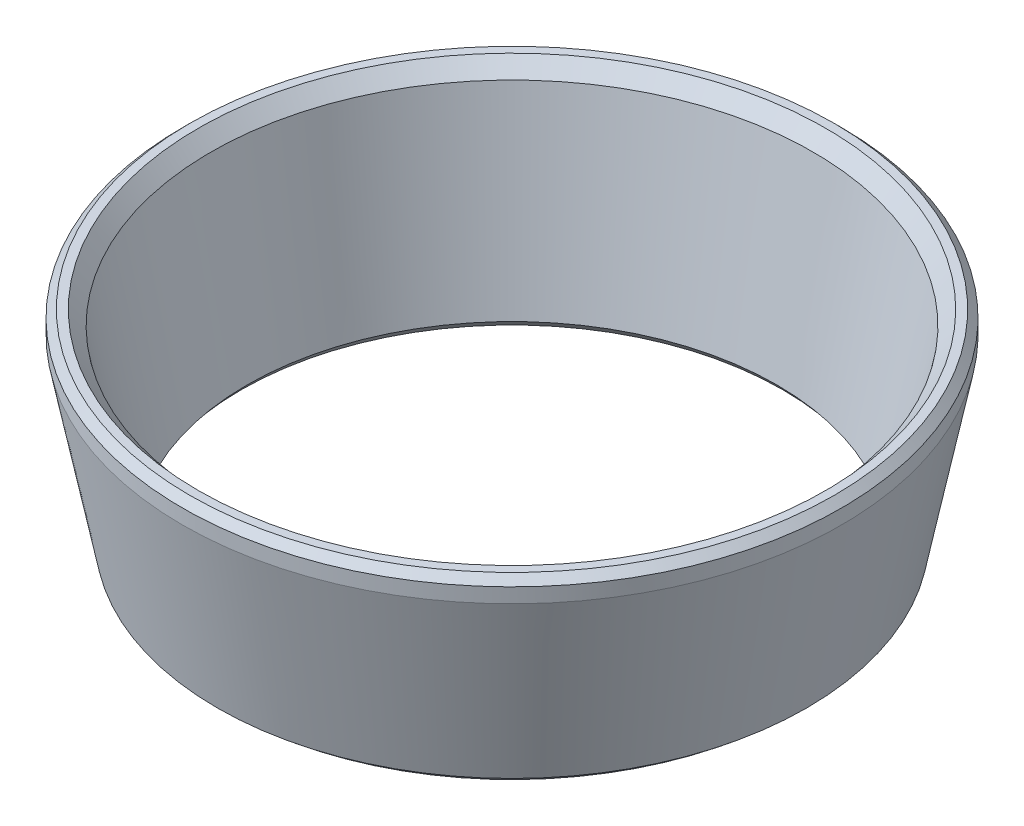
ISO-10303-21;
HEADER;
FILE_DESCRIPTION(('STEP AP214'),'2;1');
FILE_NAME('part.step','',(''),(''),'','','');
FILE_SCHEMA(('AUTOMOTIVE_DESIGN { 1 0 10303 214 1 1 1 1 }'));
ENDSEC;
DATA;
#1=APPLICATION_CONTEXT('core data for automotive mechanical design processes');
#2=APPLICATION_PROTOCOL_DEFINITION('international standard','automotive_design',2000,#1);
#3=PRODUCT_CONTEXT('',#1,'mechanical');
#4=PRODUCT('Part','Part','',(#3));
#5=PRODUCT_RELATED_PRODUCT_CATEGORY('part','',(#4));
#6=PRODUCT_DEFINITION_FORMATION('','',#4);
#7=PRODUCT_DEFINITION_CONTEXT('part definition',#1,'design');
#8=PRODUCT_DEFINITION('design','',#6,#7);
#9=PRODUCT_DEFINITION_SHAPE('','',#8);
#10=(LENGTH_UNIT() NAMED_UNIT(*) SI_UNIT(.MILLI.,.METRE.));
#11=(NAMED_UNIT(*) PLANE_ANGLE_UNIT() SI_UNIT($,.RADIAN.));
#12=(NAMED_UNIT(*) SI_UNIT($,.STERADIAN.) SOLID_ANGLE_UNIT());
#13=UNCERTAINTY_MEASURE_WITH_UNIT(LENGTH_MEASURE(1.E-05),#10,'distance_accuracy_value','');
#14=(GEOMETRIC_REPRESENTATION_CONTEXT(3) GLOBAL_UNCERTAINTY_ASSIGNED_CONTEXT((#13)) GLOBAL_UNIT_ASSIGNED_CONTEXT((#10,
#11,#12)) REPRESENTATION_CONTEXT('',''));
#15=CARTESIAN_POINT('',(0.,0.,0.));
#16=DIRECTION('',(0.,0.,1.));
#17=DIRECTION('',(1.,0.,0.));
#18=AXIS2_PLACEMENT_3D('',#15,#16,#17);
#19=CARTESIAN_POINT('',(0.,14.,0.));
#20=DIRECTION('',(0.,1.,0.));
#21=DIRECTION('',(0.,0.,1.));
#22=AXIS2_PLACEMENT_3D('',#19,#20,#21);
#23=CONICAL_SURFACE('',#22,20.7579771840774,0.195302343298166);
#24=CARTESIAN_POINT('',(0.,0.490494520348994,0.));
#25=DIRECTION('',(0.,-1.,0.));
#26=DIRECTION('',(0.,0.,-1.));
#27=AXIS2_PLACEMENT_3D('',#24,#25,#26);
#28=CIRCLE('',#27,18.0854732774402);
#29=CARTESIAN_POINT('',(0.,0.490494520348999,18.0854732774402));
#30=VERTEX_POINT('',#29);
#31=EDGE_CURVE('E10',#30,#30,#28,.T.);
#32=CARTESIAN_POINT('',(0.,13.0190109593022,0.));
#33=DIRECTION('',(0.,-1.,0.));
#34=DIRECTION('',(0.,0.,-1.));
#35=AXIS2_PLACEMENT_3D('',#32,#33,#34);
#36=CIRCLE('',#35,20.5639140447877);
#37=CARTESIAN_POINT('',(0.,13.0190109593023,20.5639140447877));
#38=VERTEX_POINT('',#37);
#39=EDGE_CURVE('E60',#38,#38,#36,.F.);
#40=CARTESIAN_POINT('',(0.,0.490494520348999,18.0854732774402));
#41=CARTESIAN_POINT('',(0.,0.620999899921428,18.1112903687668));
#42=CARTESIAN_POINT('',(0.,0.751505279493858,18.1371074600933));
#43=CARTESIAN_POINT('',(0.,1.01251603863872,18.1887416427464));
#44=CARTESIAN_POINT('',(0.,1.14302141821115,18.2145587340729));
#45=CARTESIAN_POINT('',(0.,1.40403217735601,18.266192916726));
#46=CARTESIAN_POINT('',(0.,1.53453755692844,18.2920100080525));
#47=CARTESIAN_POINT('',(0.,1.7955483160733,18.3436441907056));
#48=CARTESIAN_POINT('',(0.,1.92605369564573,18.3694612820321));
#49=CARTESIAN_POINT('',(0.,2.18706445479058,18.4210954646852));
#50=CARTESIAN_POINT('',(0.,2.31756983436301,18.4469125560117));
#51=CARTESIAN_POINT('',(0.,2.57858059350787,18.4985467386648));
#52=CARTESIAN_POINT('',(0.,2.7090859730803,18.5243638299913));
#53=CARTESIAN_POINT('',(0.,2.97009673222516,18.5759980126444));
#54=CARTESIAN_POINT('',(0.,3.10060211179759,18.6018151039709));
#55=CARTESIAN_POINT('',(0.,3.36161287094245,18.653449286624));
#56=CARTESIAN_POINT('',(0.,3.49211825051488,18.6792663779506));
#57=CARTESIAN_POINT('',(0.,3.75312900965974,18.7309005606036));
#58=CARTESIAN_POINT('',(0.,3.88363438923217,18.7567176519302));
#59=CARTESIAN_POINT('',(0.,4.14464514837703,18.8083518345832));
#60=CARTESIAN_POINT('',(0.,4.27515052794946,18.8341689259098));
#61=CARTESIAN_POINT('',(0.,4.53616128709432,18.8858031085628));
#62=CARTESIAN_POINT('',(0.,4.66666666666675,18.9116201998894));
#63=CARTESIAN_POINT('',(0.,4.92767742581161,18.9632543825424));
#64=CARTESIAN_POINT('',(0.,5.05818280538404,18.989071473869));
#65=CARTESIAN_POINT('',(0.,5.3191935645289,19.0407056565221));
#66=CARTESIAN_POINT('',(0.,5.44969894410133,19.0665227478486));
#67=CARTESIAN_POINT('',(0.,5.71070970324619,19.1181569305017));
#68=CARTESIAN_POINT('',(0.,5.84121508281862,19.1439740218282));
#69=CARTESIAN_POINT('',(0.,6.10222584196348,19.1956082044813));
#70=CARTESIAN_POINT('',(0.,6.23273122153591,19.2214252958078));
#71=CARTESIAN_POINT('',(0.,6.49374198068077,19.2730594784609));
#72=CARTESIAN_POINT('',(0.,6.6242473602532,19.2988765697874));
#73=CARTESIAN_POINT('',(0.,6.88525811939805,19.3505107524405));
#74=CARTESIAN_POINT('',(0.,7.01576349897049,19.376327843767));
#75=CARTESIAN_POINT('',(0.,7.27677425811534,19.4279620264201));
#76=CARTESIAN_POINT('',(0.,7.40727963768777,19.4537791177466));
#77=CARTESIAN_POINT('',(0.,7.66829039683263,19.5054133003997));
#78=CARTESIAN_POINT('',(0.,7.79879577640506,19.5312303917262));
#79=CARTESIAN_POINT('',(0.,8.05980653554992,19.5828645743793));
#80=CARTESIAN_POINT('',(0.,8.19031191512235,19.6086816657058));
#81=CARTESIAN_POINT('',(0.,8.45132267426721,19.6603158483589));
#82=CARTESIAN_POINT('',(0.,8.58182805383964,19.6861329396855));
#83=CARTESIAN_POINT('',(0.,8.8428388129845,19.7377671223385));
#84=CARTESIAN_POINT('',(0.,8.97334419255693,19.7635842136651));
#85=CARTESIAN_POINT('',(0.,9.23435495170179,19.8152183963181));
#86=CARTESIAN_POINT('',(0.,9.36486033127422,19.8410354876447));
#87=CARTESIAN_POINT('',(0.,9.62587109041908,19.8926696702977));
#88=CARTESIAN_POINT('',(0.,9.75637646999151,19.9184867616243));
#89=CARTESIAN_POINT('',(0.,10.0173872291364,19.9701209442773));
#90=CARTESIAN_POINT('',(0.,10.1478926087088,19.9959380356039));
#91=CARTESIAN_POINT('',(0.,10.4089033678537,20.047572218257));
#92=CARTESIAN_POINT('',(0.,10.5394087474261,20.0733893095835));
#93=CARTESIAN_POINT('',(0.,10.8004195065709,20.1250234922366));
#94=CARTESIAN_POINT('',(0.,10.9309248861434,20.1508405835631));
#95=CARTESIAN_POINT('',(0.,11.1919356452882,20.2024747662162));
#96=CARTESIAN_POINT('',(0.,11.3224410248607,20.2282918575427));
#97=CARTESIAN_POINT('',(0.,11.5834517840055,20.2799260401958));
#98=CARTESIAN_POINT('',(0.,11.713957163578,20.3057431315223));
#99=CARTESIAN_POINT('',(0.,11.9749679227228,20.3573773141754));
#100=CARTESIAN_POINT('',(0.,12.1054733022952,20.3831944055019));
#101=CARTESIAN_POINT('',(0.,12.3664840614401,20.434828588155));
#102=CARTESIAN_POINT('',(0.,12.4969894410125,20.4606456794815));
#103=CARTESIAN_POINT('',(0.,12.7580002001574,20.5122798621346));
#104=CARTESIAN_POINT('',(0.,12.8885055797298,20.5380969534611));
#105=CARTESIAN_POINT('',(0.,13.0190109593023,20.5639140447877));
#106=B_SPLINE_CURVE_WITH_KNOTS('',3,(#40,#41,#42,#43,#44,#45,#46,#47,#48,#49,#50,#51,#52,#53,
#54,#55,#56,#57,#58,#59,#60,#61,#62,#63,#64,#65,#66,#67,#68,#69,#70,#71,#72,#73,#74,#75,#76,#77,
#78,#79,#80,#81,#82,#83,#84,#85,#86,#87,#88,#89,#90,#91,#92,#93,#94,#95,#96,#97,#98,#99,#100,
#101,#102,#103,#104,#105),.UNSPECIFIED.,.F.,.F.,(4,2,2,2,2,2,2,2,2,2,2,2,2,2,2,2,2,2,2,2,2,2,2,
2,2,2,2,2,2,2,2,2,4),(0.,0.399103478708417,0.798206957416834,1.19731043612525,1.59641391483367,
1.99551739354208,2.3946208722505,2.79372435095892,3.19282782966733,3.59193130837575,
3.99103478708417,4.39013826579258,4.789241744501,5.18834522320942,5.58744870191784,
5.98655218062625,6.38565565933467,6.78475913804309,7.1838626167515,7.58296609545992,
7.98206957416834,8.38117305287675,8.78027653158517,9.17938001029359,9.57848348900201,
9.97758696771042,10.3766904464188,10.7757939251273,11.1748974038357,11.5740008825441,
11.9731043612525,12.3722078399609,12.7713113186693),.UNSPECIFIED.);
#107=EDGE_CURVE('BSEAM34',#30,#38,#106,.T.);
#108=ORIENTED_EDGE('',*,*,#31,.T.);
#109=ORIENTED_EDGE('',*,*,#39,.T.);
#110=ORIENTED_EDGE('',*,*,#107,.T.);
#111=ORIENTED_EDGE('',*,*,#107,.F.);
#112=EDGE_LOOP('',(#108,#110,#109,#111));
#113=FACE_BOUND('',#112,.T.);
#114=ADVANCED_FACE('F34',(#113),#23,.F.);
#115=CARTESIAN_POINT('',(20.7579771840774,14.,0.));
#116=DIRECTION('',(0.,1.,0.));
#117=DIRECTION('',(0.,0.,1.));
#118=AXIS2_PLACEMENT_3D('',#115,#116,#117);
#119=PLANE('',#118);
#120=CARTESIAN_POINT('',(0.,14.,0.));
#121=DIRECTION('',(0.,1.,0.));
#122=DIRECTION('',(0.,0.,1.));
#123=AXIS2_PLACEMENT_3D('',#120,#121,#122);
#124=CIRCLE('',#123,22.);
#125=CARTESIAN_POINT('',(0.,14.,-21.9999999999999));
#126=VERTEX_POINT('',#125);
#127=EDGE_CURVE('E54',#126,#126,#124,.T.);
#128=ORIENTED_EDGE('',*,*,#127,.T.);
#129=EDGE_LOOP('',(#128));
#130=FACE_BOUND('',#129,.T.);
#131=CARTESIAN_POINT('',(0.,14.,0.));
#132=DIRECTION('',(0.,1.,0.));
#133=DIRECTION('',(0.,0.,1.));
#134=AXIS2_PLACEMENT_3D('',#131,#132,#133);
#135=CIRCLE('',#134,21.4224026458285);
#136=CARTESIAN_POINT('',(0.,14.,21.4224026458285));
#137=VERTEX_POINT('',#136);
#138=EDGE_CURVE('E63',#137,#137,#135,.F.);
#139=ORIENTED_EDGE('',*,*,#138,.T.);
#140=EDGE_LOOP('',(#139));
#141=FACE_BOUND('',#140,.T.);
#142=ADVANCED_FACE('F74',(#130,#141),#119,.T.);
#143=CARTESIAN_POINT('',(0.,1.11022302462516E-13,0.));
#144=DIRECTION('',(0.,-1.,0.));
#145=DIRECTION('',(0.,0.,-1.));
#146=AXIS2_PLACEMENT_3D('',#143,#144,#145);
#147=CYLINDRICAL_SURFACE('',#146,22.5);
#148=CARTESIAN_POINT('',(0.,13.5,0.));
#149=DIRECTION('',(0.,1.,0.));
#150=DIRECTION('',(0.,0.,1.));
#151=AXIS2_PLACEMENT_3D('',#148,#149,#150);
#152=CIRCLE('',#151,22.5);
#153=CARTESIAN_POINT('',(0.,13.5,-22.5));
#154=VERTEX_POINT('',#153);
#155=EDGE_CURVE('E57',#154,#154,#152,.F.);
#156=CARTESIAN_POINT('',(0.,12.5,0.));
#157=DIRECTION('',(0.,-1.,0.));
#158=DIRECTION('',(0.,0.,-1.));
#159=AXIS2_PLACEMENT_3D('',#156,#157,#158);
#160=CIRCLE('',#159,22.5);
#161=CARTESIAN_POINT('',(0.,12.5,-22.5));
#162=VERTEX_POINT('',#161);
#163=EDGE_CURVE('E66',#162,#162,#160,.T.);
#164=CARTESIAN_POINT('',(0.,13.5,-22.5));
#165=CARTESIAN_POINT('',(0.,13.4895833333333,-22.5));
#166=CARTESIAN_POINT('',(0.,13.4791666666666,-22.5));
#167=CARTESIAN_POINT('',(0.,13.4583333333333,-22.5));
#168=CARTESIAN_POINT('',(0.,13.4479166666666,-22.5));
#169=CARTESIAN_POINT('',(0.,13.4270833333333,-22.5));
#170=CARTESIAN_POINT('',(0.,13.4166666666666,-22.5));
#171=CARTESIAN_POINT('',(0.,13.3958333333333,-22.5));
#172=CARTESIAN_POINT('',(0.,13.3854166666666,-22.5));
#173=CARTESIAN_POINT('',(0.,13.3645833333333,-22.5));
#174=CARTESIAN_POINT('',(0.,13.3541666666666,-22.5));
#175=CARTESIAN_POINT('',(0.,13.3333333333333,-22.5));
#176=CARTESIAN_POINT('',(0.,13.3229166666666,-22.5));
#177=CARTESIAN_POINT('',(0.,13.3020833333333,-22.5));
#178=CARTESIAN_POINT('',(0.,13.2916666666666,-22.5));
#179=CARTESIAN_POINT('',(0.,13.2708333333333,-22.5));
#180=CARTESIAN_POINT('',(0.,13.2604166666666,-22.5));
#181=CARTESIAN_POINT('',(0.,13.2395833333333,-22.5));
#182=CARTESIAN_POINT('',(0.,13.2291666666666,-22.5));
#183=CARTESIAN_POINT('',(0.,13.2083333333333,-22.5));
#184=CARTESIAN_POINT('',(0.,13.1979166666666,-22.5));
#185=CARTESIAN_POINT('',(0.,13.1770833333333,-22.5));
#186=CARTESIAN_POINT('',(0.,13.1666666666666,-22.5));
#187=CARTESIAN_POINT('',(0.,13.1458333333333,-22.5));
#188=CARTESIAN_POINT('',(0.,13.1354166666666,-22.5));
#189=CARTESIAN_POINT('',(0.,13.1145833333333,-22.5));
#190=CARTESIAN_POINT('',(0.,13.1041666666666,-22.5));
#191=CARTESIAN_POINT('',(0.,13.0833333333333,-22.5));
#192=CARTESIAN_POINT('',(0.,13.0729166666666,-22.5));
#193=CARTESIAN_POINT('',(0.,13.0520833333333,-22.5));
#194=CARTESIAN_POINT('',(0.,13.0416666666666,-22.5));
#195=CARTESIAN_POINT('',(0.,13.0208333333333,-22.5));
#196=CARTESIAN_POINT('',(0.,13.0104166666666,-22.5));
#197=CARTESIAN_POINT('',(0.,12.9895833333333,-22.5));
#198=CARTESIAN_POINT('',(0.,12.9791666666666,-22.5));
#199=CARTESIAN_POINT('',(0.,12.9583333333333,-22.5));
#200=CARTESIAN_POINT('',(0.,12.9479166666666,-22.5));
#201=CARTESIAN_POINT('',(0.,12.9270833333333,-22.5));
#202=CARTESIAN_POINT('',(0.,12.9166666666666,-22.5));
#203=CARTESIAN_POINT('',(0.,12.8958333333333,-22.5));
#204=CARTESIAN_POINT('',(0.,12.8854166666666,-22.5));
#205=CARTESIAN_POINT('',(0.,12.8645833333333,-22.5));
#206=CARTESIAN_POINT('',(0.,12.8541666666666,-22.5));
#207=CARTESIAN_POINT('',(0.,12.8333333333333,-22.5));
#208=CARTESIAN_POINT('',(0.,12.8229166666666,-22.5));
#209=CARTESIAN_POINT('',(0.,12.8020833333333,-22.5));
#210=CARTESIAN_POINT('',(0.,12.7916666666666,-22.5));
#211=CARTESIAN_POINT('',(0.,12.7708333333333,-22.5));
#212=CARTESIAN_POINT('',(0.,12.7604166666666,-22.5));
#213=CARTESIAN_POINT('',(0.,12.7395833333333,-22.5));
#214=CARTESIAN_POINT('',(0.,12.7291666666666,-22.5));
#215=CARTESIAN_POINT('',(0.,12.7083333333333,-22.5));
#216=CARTESIAN_POINT('',(0.,12.6979166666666,-22.5));
#217=CARTESIAN_POINT('',(0.,12.6770833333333,-22.5));
#218=CARTESIAN_POINT('',(0.,12.6666666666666,-22.5));
#219=CARTESIAN_POINT('',(0.,12.6458333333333,-22.5));
#220=CARTESIAN_POINT('',(0.,12.6354166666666,-22.5));
#221=CARTESIAN_POINT('',(0.,12.6145833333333,-22.5));
#222=CARTESIAN_POINT('',(0.,12.6041666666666,-22.5));
#223=CARTESIAN_POINT('',(0.,12.5833333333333,-22.5));
#224=CARTESIAN_POINT('',(0.,12.5729166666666,-22.5));
#225=CARTESIAN_POINT('',(0.,12.5520833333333,-22.5));
#226=CARTESIAN_POINT('',(0.,12.5416666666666,-22.5));
#227=CARTESIAN_POINT('',(0.,12.5208333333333,-22.5));
#228=CARTESIAN_POINT('',(0.,12.5104166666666,-22.5));
#229=CARTESIAN_POINT('',(0.,12.5,-22.5));
#230=B_SPLINE_CURVE_WITH_KNOTS('',3,(#164,#165,#166,#167,#168,#169,#170,#171,#172,#173,#174,
#175,#176,#177,#178,#179,#180,#181,#182,#183,#184,#185,#186,#187,#188,#189,#190,#191,#192,#193,
#194,#195,#196,#197,#198,#199,#200,#201,#202,#203,#204,#205,#206,#207,#208,#209,#210,#211,#212,
#213,#214,#215,#216,#217,#218,#219,#220,#221,#222,#223,#224,#225,#226,#227,#228,#229),
.UNSPECIFIED.,.F.,.F.,(4,2,2,2,2,2,2,2,2,2,2,2,2,2,2,2,2,2,2,2,2,2,2,2,2,2,2,2,2,2,2,2,4),(0.,
0.03125,0.0625000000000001,0.0937500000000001,0.125,0.15625,0.1875,0.21875,0.25,0.28125,0.3125,
0.34375,0.375,0.40625,0.4375,0.46875,0.5,0.53125,0.5625,0.593750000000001,0.625000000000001,
0.656250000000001,0.687500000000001,0.718750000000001,0.750000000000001,0.781250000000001,
0.812500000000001,0.843750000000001,0.875000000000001,0.906250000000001,0.937500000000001,
0.968750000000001,1.),.UNSPECIFIED.);
#231=EDGE_CURVE('BSEAM72',#154,#162,#230,.T.);
#232=ORIENTED_EDGE('',*,*,#155,.T.);
#233=ORIENTED_EDGE('',*,*,#163,.F.);
#234=ORIENTED_EDGE('',*,*,#231,.T.);
#235=ORIENTED_EDGE('',*,*,#231,.F.);
#236=EDGE_LOOP('',(#232,#234,#233,#235));
#237=FACE_BOUND('',#236,.T.);
#238=ADVANCED_FACE('F72',(#237),#147,.T.);
#239=CARTESIAN_POINT('',(0.,1.11022302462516E-13,0.));
#240=DIRECTION('',(0.,1.,0.));
#241=DIRECTION('',(0.,0.,1.));
#242=AXIS2_PLACEMENT_3D('',#239,#240,#241);
#243=CONICAL_SURFACE('',#242,20.0272004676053,0.195302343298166);
#244=CARTESIAN_POINT('',(0.,0.490494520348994,0.));
#245=DIRECTION('',(0.,-1.,0.));
#246=DIRECTION('',(0.,0.,-1.));
#247=AXIS2_PLACEMENT_3D('',#244,#245,#246);
#248=CIRCLE('',#247,20.1242320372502);
#249=CARTESIAN_POINT('',(0.,0.490494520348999,20.1242320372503));
#250=VERTEX_POINT('',#249);
#251=EDGE_CURVE('E41',#250,#250,#248,.F.);
#252=ORIENTED_EDGE('',*,*,#251,.T.);
#253=EDGE_LOOP('',(#252));
#254=FACE_BOUND('',#253,.T.);
#255=ORIENTED_EDGE('',*,*,#163,.T.);
#256=EDGE_LOOP('',(#255));
#257=FACE_BOUND('',#256,.T.);
#258=ADVANCED_FACE('F70',(#254,#257),#243,.T.);
#259=CARTESIAN_POINT('',(20.0272004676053,0.,0.));
#260=DIRECTION('',(0.,-1.,0.));
#261=DIRECTION('',(0.,0.,-1.));
#262=AXIS2_PLACEMENT_3D('',#259,#260,#261);
#263=PLANE('',#262);
#264=CARTESIAN_POINT('',(0.,1.11022302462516E-13,0.));
#265=DIRECTION('',(0.,-1.,0.));
#266=DIRECTION('',(0.,0.,-1.));
#267=AXIS2_PLACEMENT_3D('',#264,#265,#266);
#268=CIRCLE('',#267,19.5272004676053);
#269=CARTESIAN_POINT('',(0.,1.16171195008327E-13,19.5272004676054));
#270=VERTEX_POINT('',#269);
#271=EDGE_CURVE('E45',#270,#270,#268,.T.);
#272=ORIENTED_EDGE('',*,*,#271,.T.);
#273=EDGE_LOOP('',(#272));
#274=FACE_BOUND('',#273,.T.);
#275=CARTESIAN_POINT('',(0.,1.11022302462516E-13,0.));
#276=DIRECTION('',(0.,-1.,0.));
#277=DIRECTION('',(0.,0.,-1.));
#278=AXIS2_PLACEMENT_3D('',#275,#276,#277);
#279=CIRCLE('',#278,18.4884417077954);
#280=CARTESIAN_POINT('',(0.,1.15897297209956E-13,-18.4884417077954));
#281=VERTEX_POINT('',#280);
#282=EDGE_CURVE('E49',#281,#281,#279,.F.);
#283=ORIENTED_EDGE('',*,*,#282,.T.);
#284=EDGE_LOOP('',(#283));
#285=FACE_BOUND('',#284,.T.);
#286=ADVANCED_FACE('F81',(#274,#285),#263,.T.);
#287=CARTESIAN_POINT('',(0.,14.,0.));
#288=DIRECTION('',(0.,1.,0.));
#289=DIRECTION('',(0.,0.,1.));
#290=AXIS2_PLACEMENT_3D('',#287,#288,#289);
#291=CONICAL_SURFACE('',#290,21.4224026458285,0.718901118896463);
#292=CARTESIAN_POINT('',(0.,13.0190109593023,20.5639140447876));
#293=CARTESIAN_POINT('',(0.,13.0292295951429,20.5728566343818));
#294=CARTESIAN_POINT('',(0.,13.0394482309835,20.581799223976));
#295=CARTESIAN_POINT('',(0.,13.0598855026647,20.5996844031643));
#296=CARTESIAN_POINT('',(0.,13.0701041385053,20.6086269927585));
#297=CARTESIAN_POINT('',(0.,13.0905414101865,20.6265121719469));
#298=CARTESIAN_POINT('',(0.,13.1007600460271,20.635454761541));
#299=CARTESIAN_POINT('',(0.,13.1211973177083,20.6533399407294));
#300=CARTESIAN_POINT('',(0.,13.1314159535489,20.6622825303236));
#301=CARTESIAN_POINT('',(0.,13.1518532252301,20.6801677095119));
#302=CARTESIAN_POINT('',(0.,13.1620718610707,20.6891102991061));
#303=CARTESIAN_POINT('',(0.,13.1825091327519,20.7069954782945));
#304=CARTESIAN_POINT('',(0.,13.1927277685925,20.7159380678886));
#305=CARTESIAN_POINT('',(0.,13.2131650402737,20.733823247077));
#306=CARTESIAN_POINT('',(0.,13.2233836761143,20.7427658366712));
#307=CARTESIAN_POINT('',(0.,13.2438209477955,20.7606510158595));
#308=CARTESIAN_POINT('',(0.,13.2540395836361,20.7695936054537));
#309=CARTESIAN_POINT('',(0.,13.2744768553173,20.787478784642));
#310=CARTESIAN_POINT('',(0.,13.2846954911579,20.7964213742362));
#311=CARTESIAN_POINT('',(0.,13.3051327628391,20.8143065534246));
#312=CARTESIAN_POINT('',(0.,13.3153513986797,20.8232491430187));
#313=CARTESIAN_POINT('',(0.,13.3357886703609,20.8411343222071));
#314=CARTESIAN_POINT('',(0.,13.3460073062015,20.8500769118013));
#315=CARTESIAN_POINT('',(0.,13.3664445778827,20.8679620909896));
#316=CARTESIAN_POINT('',(0.,13.3766632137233,20.8769046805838));
#317=CARTESIAN_POINT('',(0.,13.3971004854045,20.8947898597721));
#318=CARTESIAN_POINT('',(0.,13.4073191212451,20.9037324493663));
#319=CARTESIAN_POINT('',(0.,13.4277563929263,20.9216176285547));
#320=CARTESIAN_POINT('',(0.,13.4379750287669,20.9305602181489));
#321=CARTESIAN_POINT('',(0.,13.4584123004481,20.9484453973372));
#322=CARTESIAN_POINT('',(0.,13.4686309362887,20.9573879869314));
#323=CARTESIAN_POINT('',(0.,13.4890682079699,20.9752731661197));
#324=CARTESIAN_POINT('',(0.,13.4992868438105,20.9842157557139));
#325=CARTESIAN_POINT('',(0.,13.5197241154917,21.0021009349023));
#326=CARTESIAN_POINT('',(0.,13.5299427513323,21.0110435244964));
#327=CARTESIAN_POINT('',(0.,13.5503800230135,21.0289287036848));
#328=CARTESIAN_POINT('',(0.,13.5605986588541,21.037871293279));
#329=CARTESIAN_POINT('',(0.,13.5810359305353,21.0557564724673));
#330=CARTESIAN_POINT('',(0.,13.5912545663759,21.0646990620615));
#331=CARTESIAN_POINT('',(0.,13.6116918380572,21.0825842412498));
#332=CARTESIAN_POINT('',(0.,13.6219104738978,21.091526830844));
#333=CARTESIAN_POINT('',(0.,13.642347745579,21.1094120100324));
#334=CARTESIAN_POINT('',(0.,13.6525663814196,21.1183545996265));
#335=CARTESIAN_POINT('',(0.,13.6730036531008,21.1362397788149));
#336=CARTESIAN_POINT('',(0.,13.6832222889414,21.1451823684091));
#337=CARTESIAN_POINT('',(0.,13.7036595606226,21.1630675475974));
#338=CARTESIAN_POINT('',(0.,13.7138781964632,21.1720101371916));
#339=CARTESIAN_POINT('',(0.,13.7343154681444,21.1898953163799));
#340=CARTESIAN_POINT('',(0.,13.744534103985,21.1988379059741));
#341=CARTESIAN_POINT('',(0.,13.7649713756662,21.2167230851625));
#342=CARTESIAN_POINT('',(0.,13.7751900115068,21.2256656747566));
#343=CARTESIAN_POINT('',(0.,13.795627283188,21.243550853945));
#344=CARTESIAN_POINT('',(0.,13.8058459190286,21.2524934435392));
#345=CARTESIAN_POINT('',(0.,13.8262831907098,21.2703786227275));
#346=CARTESIAN_POINT('',(0.,13.8365018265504,21.2793212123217));
#347=CARTESIAN_POINT('',(0.,13.8569390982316,21.2972063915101));
#348=CARTESIAN_POINT('',(0.,13.8671577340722,21.3061489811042));
#349=CARTESIAN_POINT('',(0.,13.8875950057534,21.3240341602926));
#350=CARTESIAN_POINT('',(0.,13.897813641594,21.3329767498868));
#351=CARTESIAN_POINT('',(0.,13.9182509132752,21.3508619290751));
#352=CARTESIAN_POINT('',(0.,13.9284695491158,21.3598045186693));
#353=CARTESIAN_POINT('',(0.,13.948906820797,21.3776896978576));
#354=CARTESIAN_POINT('',(0.,13.9591254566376,21.3866322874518));
#355=CARTESIAN_POINT('',(0.,13.9795627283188,21.4045174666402));
#356=CARTESIAN_POINT('',(0.,13.9897813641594,21.4134600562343));
#357=CARTESIAN_POINT('',(0.,14.,21.4224026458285));
#358=B_SPLINE_CURVE_WITH_KNOTS('',3,(#292,#293,#294,#295,#296,#297,#298,#299,#300,#301,#302,
#303,#304,#305,#306,#307,#308,#309,#310,#311,#312,#313,#314,#315,#316,#317,#318,#319,#320,#321,
#322,#323,#324,#325,#326,#327,#328,#329,#330,#331,#332,#333,#334,#335,#336,#337,#338,#339,#340,
#341,#342,#343,#344,#345,#346,#347,#348,#349,#350,#351,#352,#353,#354,#355,#356,#357),
.UNSPECIFIED.,.F.,.F.,(4,2,2,2,2,2,2,2,2,2,2,2,2,2,2,2,2,2,2,2,2,2,2,2,2,2,2,2,2,2,2,2,4),(0.,
0.0407371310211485,0.081474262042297,0.122211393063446,0.162948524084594,0.203685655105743,
0.244422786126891,0.28515991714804,0.325897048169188,0.366634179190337,0.407371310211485,
0.448108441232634,0.488845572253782,0.529582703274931,0.570319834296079,0.611056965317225,
0.651794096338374,0.692531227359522,0.733268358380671,0.774005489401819,0.814742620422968,
0.855479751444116,0.896216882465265,0.936954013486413,0.977691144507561,1.01842827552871,
1.05916540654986,1.09990253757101,1.14063966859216,1.18137679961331,1.22211393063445,
1.2628510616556,1.30358819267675),.UNSPECIFIED.);
#359=EDGE_CURVE('BSEAM91',#38,#137,#358,.T.);
#360=ORIENTED_EDGE('',*,*,#39,.F.);
#361=ORIENTED_EDGE('',*,*,#138,.F.);
#362=ORIENTED_EDGE('',*,*,#359,.T.);
#363=ORIENTED_EDGE('',*,*,#359,.F.);
#364=EDGE_LOOP('',(#360,#362,#361,#363));
#365=FACE_BOUND('',#364,.T.);
#366=ADVANCED_FACE('F91',(#365),#291,.F.);
#367=CARTESIAN_POINT('',(0.,13.5,0.));
#368=DIRECTION('',(0.,-1.,0.));
#369=DIRECTION('',(0.,0.,-1.));
#370=AXIS2_PLACEMENT_3D('',#367,#368,#369);
#371=CONICAL_SURFACE('',#370,22.5,0.785398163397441);
#372=CARTESIAN_POINT('',(0.,14.,-21.9999999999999));
#373=CARTESIAN_POINT('',(0.,13.9947916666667,-22.0052083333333));
#374=CARTESIAN_POINT('',(0.,13.9895833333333,-22.0104166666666));
#375=CARTESIAN_POINT('',(0.,13.9791666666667,-22.0208333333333));
#376=CARTESIAN_POINT('',(0.,13.9739583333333,-22.0260416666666));
#377=CARTESIAN_POINT('',(0.,13.9635416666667,-22.0364583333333));
#378=CARTESIAN_POINT('',(0.,13.9583333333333,-22.0416666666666));
#379=CARTESIAN_POINT('',(0.,13.9479166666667,-22.0520833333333));
#380=CARTESIAN_POINT('',(0.,13.9427083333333,-22.0572916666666));
#381=CARTESIAN_POINT('',(0.,13.9322916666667,-22.0677083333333));
#382=CARTESIAN_POINT('',(0.,13.9270833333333,-22.0729166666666));
#383=CARTESIAN_POINT('',(0.,13.9166666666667,-22.0833333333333));
#384=CARTESIAN_POINT('',(0.,13.9114583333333,-22.0885416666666));
#385=CARTESIAN_POINT('',(0.,13.9010416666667,-22.0989583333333));
#386=CARTESIAN_POINT('',(0.,13.8958333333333,-22.1041666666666));
#387=CARTESIAN_POINT('',(0.,13.8854166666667,-22.1145833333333));
#388=CARTESIAN_POINT('',(0.,13.8802083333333,-22.1197916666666));
#389=CARTESIAN_POINT('',(0.,13.8697916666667,-22.1302083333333));
#390=CARTESIAN_POINT('',(0.,13.8645833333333,-22.1354166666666));
#391=CARTESIAN_POINT('',(0.,13.8541666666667,-22.1458333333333));
#392=CARTESIAN_POINT('',(0.,13.8489583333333,-22.1510416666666));
#393=CARTESIAN_POINT('',(0.,13.8385416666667,-22.1614583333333));
#394=CARTESIAN_POINT('',(0.,13.8333333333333,-22.1666666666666));
#395=CARTESIAN_POINT('',(0.,13.8229166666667,-22.1770833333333));
#396=CARTESIAN_POINT('',(0.,13.8177083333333,-22.1822916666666));
#397=CARTESIAN_POINT('',(0.,13.8072916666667,-22.1927083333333));
#398=CARTESIAN_POINT('',(0.,13.8020833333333,-22.1979166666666));
#399=CARTESIAN_POINT('',(0.,13.7916666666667,-22.2083333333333));
#400=CARTESIAN_POINT('',(0.,13.7864583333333,-22.2135416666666));
#401=CARTESIAN_POINT('',(0.,13.7760416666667,-22.2239583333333));
#402=CARTESIAN_POINT('',(0.,13.7708333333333,-22.2291666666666));
#403=CARTESIAN_POINT('',(0.,13.7604166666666,-22.2395833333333));
#404=CARTESIAN_POINT('',(0.,13.7552083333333,-22.2447916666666));
#405=CARTESIAN_POINT('',(0.,13.7447916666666,-22.2552083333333));
#406=CARTESIAN_POINT('',(0.,13.7395833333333,-22.2604166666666));
#407=CARTESIAN_POINT('',(0.,13.7291666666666,-22.2708333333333));
#408=CARTESIAN_POINT('',(0.,13.7239583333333,-22.2760416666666));
#409=CARTESIAN_POINT('',(0.,13.7135416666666,-22.2864583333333));
#410=CARTESIAN_POINT('',(0.,13.7083333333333,-22.2916666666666));
#411=CARTESIAN_POINT('',(0.,13.6979166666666,-22.3020833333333));
#412=CARTESIAN_POINT('',(0.,13.6927083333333,-22.3072916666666));
#413=CARTESIAN_POINT('',(0.,13.6822916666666,-22.3177083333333));
#414=CARTESIAN_POINT('',(0.,13.6770833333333,-22.3229166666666));
#415=CARTESIAN_POINT('',(0.,13.6666666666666,-22.3333333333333));
#416=CARTESIAN_POINT('',(0.,13.6614583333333,-22.3385416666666));
#417=CARTESIAN_POINT('',(0.,13.6510416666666,-22.3489583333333));
#418=CARTESIAN_POINT('',(0.,13.6458333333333,-22.3541666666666));
#419=CARTESIAN_POINT('',(0.,13.6354166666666,-22.3645833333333));
#420=CARTESIAN_POINT('',(0.,13.6302083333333,-22.3697916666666));
#421=CARTESIAN_POINT('',(0.,13.6197916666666,-22.3802083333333));
#422=CARTESIAN_POINT('',(0.,13.6145833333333,-22.3854166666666));
#423=CARTESIAN_POINT('',(0.,13.6041666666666,-22.3958333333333));
#424=CARTESIAN_POINT('',(0.,13.5989583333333,-22.4010416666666));
#425=CARTESIAN_POINT('',(0.,13.5885416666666,-22.4114583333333));
#426=CARTESIAN_POINT('',(0.,13.5833333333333,-22.4166666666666));
#427=CARTESIAN_POINT('',(0.,13.5729166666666,-22.4270833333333));
#428=CARTESIAN_POINT('',(0.,13.5677083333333,-22.4322916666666));
#429=CARTESIAN_POINT('',(0.,13.5572916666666,-22.4427083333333));
#430=CARTESIAN_POINT('',(0.,13.5520833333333,-22.4479166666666));
#431=CARTESIAN_POINT('',(0.,13.5416666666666,-22.4583333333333));
#432=CARTESIAN_POINT('',(0.,13.5364583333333,-22.4635416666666));
#433=CARTESIAN_POINT('',(0.,13.5260416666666,-22.4739583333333));
#434=CARTESIAN_POINT('',(0.,13.5208333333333,-22.4791666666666));
#435=CARTESIAN_POINT('',(0.,13.5104166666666,-22.4895833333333));
#436=CARTESIAN_POINT('',(0.,13.5052083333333,-22.4947916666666));
#437=CARTESIAN_POINT('',(0.,13.5,-22.5));
#438=B_SPLINE_CURVE_WITH_KNOTS('',3,(#372,#373,#374,#375,#376,#377,#378,#379,#380,#381,#382,
#383,#384,#385,#386,#387,#388,#389,#390,#391,#392,#393,#394,#395,#396,#397,#398,#399,#400,#401,
#402,#403,#404,#405,#406,#407,#408,#409,#410,#411,#412,#413,#414,#415,#416,#417,#418,#419,#420,
#421,#422,#423,#424,#425,#426,#427,#428,#429,#430,#431,#432,#433,#434,#435,#436,#437),
.UNSPECIFIED.,.F.,.F.,(4,2,2,2,2,2,2,2,2,2,2,2,2,2,2,2,2,2,2,2,2,2,2,2,2,2,2,2,2,2,2,2,4),(0.,
0.0220970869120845,0.0441941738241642,0.0662912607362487,0.0883883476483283,0.110485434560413,
0.132582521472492,0.154679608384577,0.176776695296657,0.198873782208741,0.220970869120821,
0.243067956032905,0.265165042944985,0.287262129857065,0.309359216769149,0.331456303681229,
0.353553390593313,0.375650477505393,0.397747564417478,0.419844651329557,0.441941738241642,
0.464038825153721,0.486135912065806,0.508232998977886,0.53033008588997,0.55242717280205,
0.574524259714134,0.596621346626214,0.6187184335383,0.640815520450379,0.662912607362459,
0.685009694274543,0.707106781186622),.UNSPECIFIED.);
#439=EDGE_CURVE('BSEAM94',#126,#154,#438,.T.);
#440=ORIENTED_EDGE('',*,*,#127,.F.);
#441=ORIENTED_EDGE('',*,*,#155,.F.);
#442=ORIENTED_EDGE('',*,*,#439,.T.);
#443=ORIENTED_EDGE('',*,*,#439,.F.);
#444=EDGE_LOOP('',(#440,#442,#441,#443));
#445=FACE_BOUND('',#444,.T.);
#446=ADVANCED_FACE('F94',(#445),#371,.T.);
#447=CARTESIAN_POINT('',(0.,1.11022302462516E-13,0.));
#448=DIRECTION('',(0.,1.,0.));
#449=DIRECTION('',(0.,0.,1.));
#450=AXIS2_PLACEMENT_3D('',#447,#448,#449);
#451=CONICAL_SURFACE('',#450,19.5272004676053,0.883049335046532);
#452=CARTESIAN_POINT('',(0.,0.490494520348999,20.1242320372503));
#453=CARTESIAN_POINT('',(0.,0.485385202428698,20.1180129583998));
#454=CARTESIAN_POINT('',(0.,0.480275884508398,20.1117938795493));
#455=CARTESIAN_POINT('',(0.,0.470057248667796,20.0993557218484));
#456=CARTESIAN_POINT('',(0.,0.464947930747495,20.0931366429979));
#457=CARTESIAN_POINT('',(0.,0.454729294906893,20.080698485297));
#458=CARTESIAN_POINT('',(0.,0.449619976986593,20.0744794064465));
#459=CARTESIAN_POINT('',(0.,0.43940134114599,20.0620412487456));
#460=CARTESIAN_POINT('',(0.,0.434292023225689,20.0558221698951));
#461=CARTESIAN_POINT('',(0.,0.424073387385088,20.0433840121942));
#462=CARTESIAN_POINT('',(0.,0.418964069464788,20.0371649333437));
#463=CARTESIAN_POINT('',(0.,0.408745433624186,20.0247267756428));
#464=CARTESIAN_POINT('',(0.,0.403636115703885,20.0185076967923));
#465=CARTESIAN_POINT('',(0.,0.393417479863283,20.0060695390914));
#466=CARTESIAN_POINT('',(0.,0.388308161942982,19.9998504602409));
#467=CARTESIAN_POINT('',(0.,0.37808952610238,19.98741230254));
#468=CARTESIAN_POINT('',(0.,0.37298020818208,19.9811932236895));
#469=CARTESIAN_POINT('',(0.,0.362761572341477,19.9687550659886));
#470=CARTESIAN_POINT('',(0.,0.357652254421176,19.9625359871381));
#471=CARTESIAN_POINT('',(0.,0.347433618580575,19.9500978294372));
#472=CARTESIAN_POINT('',(0.,0.342324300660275,19.9438787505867));
#473=CARTESIAN_POINT('',(0.,0.332105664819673,19.9314405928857));
#474=CARTESIAN_POINT('',(0.,0.326996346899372,19.9252215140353));
#475=CARTESIAN_POINT('',(0.,0.31677771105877,19.9127833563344));
#476=CARTESIAN_POINT('',(0.,0.311668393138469,19.9065642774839));
#477=CARTESIAN_POINT('',(0.,0.301449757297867,19.8941261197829));
#478=CARTESIAN_POINT('',(0.,0.296340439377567,19.8879070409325));
#479=CARTESIAN_POINT('',(0.,0.286121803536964,19.8754688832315));
#480=CARTESIAN_POINT('',(0.,0.281012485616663,19.8692498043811));
#481=CARTESIAN_POINT('',(0.,0.270793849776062,19.8568116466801));
#482=CARTESIAN_POINT('',(0.,0.265684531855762,19.8505925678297));
#483=CARTESIAN_POINT('',(0.,0.25546589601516,19.8381544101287));
#484=CARTESIAN_POINT('',(0.,0.250356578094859,19.8319353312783));
#485=CARTESIAN_POINT('',(0.,0.240137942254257,19.8194971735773));
#486=CARTESIAN_POINT('',(0.,0.235028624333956,19.8132780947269));
#487=CARTESIAN_POINT('',(0.,0.224809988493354,19.8008399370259));
#488=CARTESIAN_POINT('',(0.,0.219700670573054,19.7946208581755));
#489=CARTESIAN_POINT('',(0.,0.209482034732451,19.7821827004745));
#490=CARTESIAN_POINT('',(0.,0.20437271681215,19.7759636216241));
#491=CARTESIAN_POINT('',(0.,0.194154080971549,19.7635254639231));
#492=CARTESIAN_POINT('',(0.,0.189044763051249,19.7573063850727));
#493=CARTESIAN_POINT('',(0.,0.178826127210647,19.7448682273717));
#494=CARTESIAN_POINT('',(0.,0.173716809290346,19.7386491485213));
#495=CARTESIAN_POINT('',(0.,0.163498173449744,19.7262109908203));
#496=CARTESIAN_POINT('',(0.,0.158388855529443,19.7199919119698));
#497=CARTESIAN_POINT('',(0.,0.148170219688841,19.7075537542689));
#498=CARTESIAN_POINT('',(0.,0.143060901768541,19.7013346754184));
#499=CARTESIAN_POINT('',(0.,0.132842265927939,19.6888965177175));
#500=CARTESIAN_POINT('',(0.,0.127732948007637,19.682677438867));
#501=CARTESIAN_POINT('',(0.,0.117514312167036,19.6702392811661));
#502=CARTESIAN_POINT('',(0.,0.112404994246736,19.6640202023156));
#503=CARTESIAN_POINT('',(0.,0.102186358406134,19.6515820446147));
#504=CARTESIAN_POINT('',(0.,0.0970770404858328,19.6453629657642));
#505=CARTESIAN_POINT('',(0.,0.0868584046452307,19.6329248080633));
#506=CARTESIAN_POINT('',(0.,0.0817490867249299,19.6267057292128));
#507=CARTESIAN_POINT('',(0.,0.0715304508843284,19.6142675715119));
#508=CARTESIAN_POINT('',(0.,0.0664211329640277,19.6080484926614));
#509=CARTESIAN_POINT('',(0.,0.0562024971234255,19.5956103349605));
#510=CARTESIAN_POINT('',(0.,0.0510931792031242,19.58939125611));
#511=CARTESIAN_POINT('',(0.,0.0408745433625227,19.5769530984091));
#512=CARTESIAN_POINT('',(0.,0.0357652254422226,19.5707340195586));
#513=CARTESIAN_POINT('',(0.,0.0255465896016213,19.5582958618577));
#514=CARTESIAN_POINT('',(0.,0.02043727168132,19.5520767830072));
#515=CARTESIAN_POINT('',(0.,0.0102186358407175,19.5396386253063));
#516=CARTESIAN_POINT('',(0.,0.00510931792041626,19.5334195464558));
#517=CARTESIAN_POINT('',(0.,1.16173330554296E-13,19.5272004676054));
#518=B_SPLINE_CURVE_WITH_KNOTS('',3,(#452,#453,#454,#455,#456,#457,#458,#459,#460,#461,#462,
#463,#464,#465,#466,#467,#468,#469,#470,#471,#472,#473,#474,#475,#476,#477,#478,#479,#480,#481,
#482,#483,#484,#485,#486,#487,#488,#489,#490,#491,#492,#493,#494,#495,#496,#497,#498,#499,#500,
#501,#502,#503,#504,#505,#506,#507,#508,#509,#510,#511,#512,#513,#514,#515,#516,#517),
.UNSPECIFIED.,.F.,.F.,(4,2,2,2,2,2,2,2,2,2,2,2,2,2,2,2,2,2,2,2,2,2,2,2,2,2,2,2,2,2,2,2,4),(0.,
0.0241461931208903,0.0482923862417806,0.0724385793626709,0.0965847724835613,0.120730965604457,
0.144877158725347,0.169023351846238,0.193169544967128,0.217315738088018,0.241461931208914,
0.265608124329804,0.289754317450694,0.313900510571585,0.338046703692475,0.362192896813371,
0.386339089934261,0.410485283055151,0.434631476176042,0.458777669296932,0.482923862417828,
0.507070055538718,0.531216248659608,0.555362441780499,0.579508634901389,0.603654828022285,
0.627801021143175,0.651947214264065,0.676093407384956,0.700239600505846,0.724385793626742,
0.748531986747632,0.772678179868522),.UNSPECIFIED.);
#519=EDGE_CURVE('BSEAM97',#250,#270,#518,.T.);
#520=ORIENTED_EDGE('',*,*,#251,.F.);
#521=ORIENTED_EDGE('',*,*,#271,.F.);
#522=ORIENTED_EDGE('',*,*,#519,.T.);
#523=ORIENTED_EDGE('',*,*,#519,.F.);
#524=EDGE_LOOP('',(#520,#522,#521,#523));
#525=FACE_BOUND('',#524,.T.);
#526=ADVANCED_FACE('F97',(#525),#451,.T.);
#527=CARTESIAN_POINT('',(0.,0.490494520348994,0.));
#528=DIRECTION('',(0.,-1.,0.));
#529=DIRECTION('',(0.,0.,-1.));
#530=AXIS2_PLACEMENT_3D('',#527,#528,#529);
#531=CONICAL_SURFACE('',#530,18.0854732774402,0.687746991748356);
#532=ORIENTED_EDGE('',*,*,#282,.F.);
#533=EDGE_LOOP('',(#532));
#534=FACE_BOUND('',#533,.T.);
#535=ORIENTED_EDGE('',*,*,#31,.F.);
#536=EDGE_LOOP('',(#535));
#537=FACE_BOUND('',#536,.T.);
#538=ADVANCED_FACE('F36',(#534,#537),#531,.F.);
#539=CLOSED_SHELL('',(#114,#142,#238,#258,#286,#366,#446,#526,#538));
#540=MANIFOLD_SOLID_BREP('B2',#539);
#541=ADVANCED_BREP_SHAPE_REPRESENTATION('',(#18,#540),#14);
#542=SHAPE_DEFINITION_REPRESENTATION(#9,#541);
ENDSEC;
END-ISO-10303-21;
